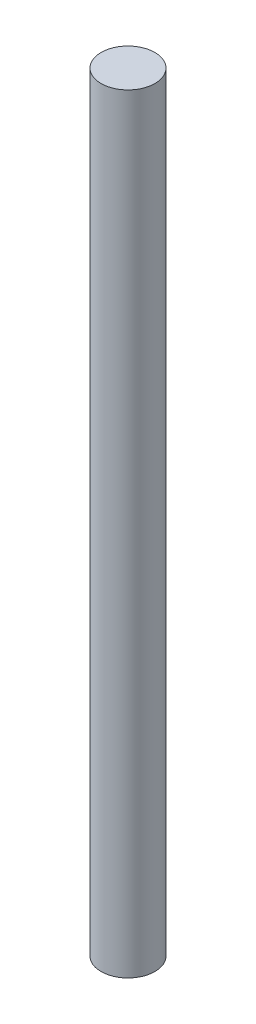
from build123d import *

# Parameters (mm, degrees)
SCHIZZO1_R                   = 17.5
ESTRUSIONE_ESTRUSIONE1_DEPTH = 500


with BuildPart() as part:
    # Schizzo1 → Estrusione-Estrusione1 (new body)
    with BuildSketch(Plane(origin=(0, 0, 0), x_dir=(1, 0, 0), z_dir=(0, 1, 0))):
        with Locations(Location((0, 0, 0), (0, 0, 270))):
            Circle(SCHIZZO1_R)
    extrude(amount=ESTRUSIONE_ESTRUSIONE1_DEPTH)


solid = part.part
